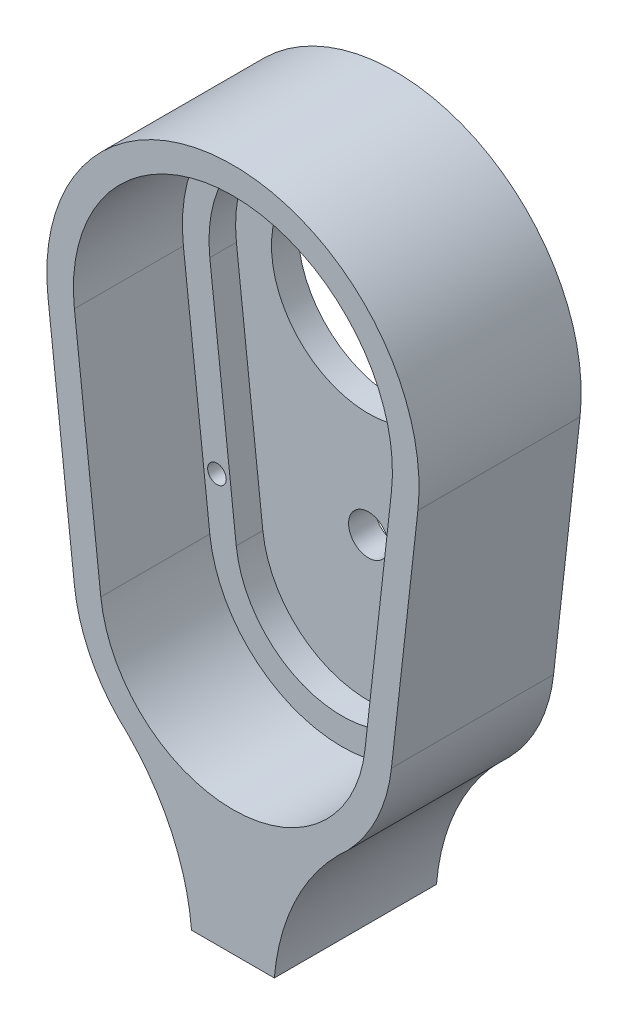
from build123d import *
from build123d.topology import SkipClean

# Parameters (mm, degrees)
BOSS_EXTRUDE_OUTER_RIM_DEPTH         = 15.494
SKETCH1_8_R                          = 9.271
SKETCH1_8_R_2                        = 0.889
BOSS_EXTRUDE_BOTTOM_DEPTH            = 2.54
BOSS_EXTRUDE_INNER_RIDGE_DEPTH       = 2.54
BOSS_EXTRUDE_HANDLE_ATTACHMENT_DEPTH = 15.494
SKETCH3_R                            = 1.905
CUT_EXTRUDE_KNOB_HOLE_DEPTH          = 2.54


with BuildPart() as part:
    # Sketch Outer Ridge → Boss-Extrude Outer Rim (new body)
    with BuildSketch(Plane.XY):
        with BuildLine():
            ThreePointArc((0, -38.1), (10.16, -34.219225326), (15.145633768, -24.553333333))
            ThreePointArc((15.145633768, -24.553333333), (15.216390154, -23.70798036), (15.24, -22.86))
            ThreePointArc((15.24, -22.86), (14.81337526, -19.279285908), (13.557386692, -15.899047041))
            Line((13.557386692, -15.899047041), (12.621361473, -24.271111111))
            ThreePointArc((12.621361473, -24.271111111), (8.466666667, -32.326021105), (0, -35.56))
            Line((0, -35.56), (0, -38.1))
        make_face()
        with BuildLine():
            ThreePointArc((-15.145633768, -24.553333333), (-10.16, -34.219225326), (0, -38.1))
            Line((0, -38.1), (0, -35.56))
            ThreePointArc((0, -35.56), (-8.466666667, -32.326021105), (-12.621361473, -24.271111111))
            Line((-12.621361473, -24.271111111), (-13.557386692, -15.899047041))
            ThreePointArc((-13.557386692, -15.899047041), (-14.989663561, -20.109075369), (-15.145633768, -24.553333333))
        make_face()
        with BuildLine():
            Line((-17.669906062, -1.975555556), (-15.145633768, -24.553333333))
            ThreePointArc((-15.145633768, -24.553333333), (-14.989663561, -20.109075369), (-13.557386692, -15.899047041))
            Line((-13.557386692, -15.899047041), (-14.128067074, -10.794726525))
            ThreePointArc((-14.128067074, -10.794726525), (-16.499158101, -6.626174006), (-17.669906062, -1.975555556))
        make_face()
        with BuildLine():
            Line((0, 15.24), (0, 17.78))
            ThreePointArc((0, 17.78), (-13.252429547, 11.853333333), (-17.669906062, -1.975555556))
            ThreePointArc((-17.669906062, -1.975555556), (-16.499158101, -6.626174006), (-14.128067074, -10.794726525))
            Line((-14.128067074, -10.794726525), (-15.145633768, -1.693333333))
            ThreePointArc((-15.145633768, -1.693333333), (-11.359225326, 10.16), (0, 15.24))
        make_face()
        with BuildLine():
            Line((15.145633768, -24.553333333), (17.669906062, -1.975555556))
            ThreePointArc((17.669906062, -1.975555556), (16.499158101, -6.626174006), (14.128067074, -10.794726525))
            Line((14.128067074, -10.794726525), (13.557386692, -15.899047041))
            ThreePointArc((13.557386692, -15.899047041), (14.81337526, -19.279285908), (15.24, -22.86))
            ThreePointArc((15.24, -22.86), (15.216390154, -23.70798036), (15.145633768, -24.553333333))
        make_face()
        with BuildLine():
            ThreePointArc((14.128067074, -10.794726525), (16.499158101, -6.626174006), (17.669906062, -1.975555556))
            ThreePointArc((17.669906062, -1.975555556), (17.752455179, -0.98931042), (17.78, 0))
            ThreePointArc((17.78, 0), (12.572358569, 12.572358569), (0, 17.78))
            Line((0, 17.78), (0, 15.24))
            ThreePointArc((0, 15.24), (10.776307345, 10.776307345), (15.24, 0))
            ThreePointArc((15.24, 0), (15.216390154, -0.84798036), (15.145633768, -1.693333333))
            Line((15.145633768, -1.693333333), (14.128067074, -10.794726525))
        make_face()
    extrude(amount=BOSS_EXTRUDE_OUTER_RIM_DEPTH)

    # Sketch1_8 → Boss-Extrude Bottom (add)
    with BuildSketch(Plane.XY):
        with BuildLine():
            ThreePointArc((15.145633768, -1.693333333), (0, 15.24), (-15.145633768, -1.693333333))
            Line((-15.145633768, -1.693333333), (-12.621361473, -24.271111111))
            ThreePointArc((-12.621361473, -24.271111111), (0, -35.56), (12.621361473, -24.271111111))
            Line((12.621361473, -24.271111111), (15.145633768, -1.693333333))
        make_face()
        Circle(SKETCH1_8_R, mode=Mode.SUBTRACT)
        with Locations((-11.938, -18.953281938)):
            Circle(SKETCH1_8_R_2, mode=Mode.SUBTRACT)
        with Locations((11.938, -18.953281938)):
            Circle(SKETCH1_8_R_2, mode=Mode.SUBTRACT)
    extrude(amount=BOSS_EXTRUDE_BOTTOM_DEPTH)

    # Sketch Inner Ridge → Boss-Extrude Inner Ridge (add)
    with SkipClean():  # the faces are left unmerged after this step: merging them gives an invalid solid
        with BuildSketch(Plane.XY.offset(2.54)):
            with BuildLine():
                Line((0, 12.7), (0, 15.24))
                ThreePointArc((0, 15.24), (-11.359225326, 10.16), (-15.145633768, -1.693333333))
                ThreePointArc((-15.145633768, -1.693333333), (-14.012017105, -5.993411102), (-11.685336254, -9.783175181))
                Line((-11.685336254, -9.783175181), (-12.621361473, -1.411111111))
                ThreePointArc((-12.621361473, -1.411111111), (-9.466021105, 8.466666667), (0, 12.7))
            make_face()
            with BuildLine():
                ThreePointArc((-11.685336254, -9.783175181), (-14.012017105, -5.993411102), (-15.145633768, -1.693333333))
                Line((-15.145633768, -1.693333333), (-12.621361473, -24.271111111))
                ThreePointArc((-12.621361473, -24.271111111), (-12.67091119, -22.000925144), (-12.315390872, -19.758202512))
                ThreePointArc((-12.315390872, -19.758202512), (-12.782908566, -18.676785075), (-11.766517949, -18.080977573))
                ThreePointArc((-11.766517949, -18.080977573), (-11.385609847, -17.233465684), (-10.943755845, -16.416072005))
                Line((-10.943755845, -16.416072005), (-11.685336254, -9.783175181))
            make_face()
            with BuildLine():
                ThreePointArc((-12.315390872, -19.758202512), (-12.67091119, -22.000925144), (-12.621361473, -24.271111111))
                ThreePointArc((-12.621361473, -24.271111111), (-8.466666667, -32.326021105), (0, -35.56))
                Line((0, -35.56), (0, -33.02))
                ThreePointArc((0, -33.02), (-6.773333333, -30.432816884), (-10.097089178, -23.988888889))
                Line((-10.097089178, -23.988888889), (-10.943755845, -16.416072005))
                ThreePointArc((-10.943755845, -16.416072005), (-11.385609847, -17.233465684), (-11.766517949, -18.080977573))
                ThreePointArc((-11.766517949, -18.080977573), (-11.251425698, -18.388537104), (-11.049, -18.953281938))
                ThreePointArc((-11.049, -18.953281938), (-11.461124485, -19.703555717), (-12.315390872, -19.758202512))
            make_face()
            with BuildLine():
                ThreePointArc((0, -35.56), (8.466666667, -32.326021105), (12.621361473, -24.271111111))
                ThreePointArc((12.621361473, -24.271111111), (12.680325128, -23.5666503), (12.7, -22.86))
                ThreePointArc((12.7, -22.86), (12.603480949, -21.297224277), (12.315390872, -19.758202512))
                ThreePointArc((12.315390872, -19.758202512), (11.093091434, -19.229778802), (11.766517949, -18.080977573))
                ThreePointArc((11.766517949, -18.080977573), (11.385609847, -17.233465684), (10.943755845, -16.416072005))
                Line((10.943755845, -16.416072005), (10.097089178, -23.988888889))
                ThreePointArc((10.097089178, -23.988888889), (6.773333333, -30.432816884), (0, -33.02))
                Line((0, -33.02), (0, -35.56))
            make_face()
            with BuildLine():
                Line((12.621361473, -24.271111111), (15.145633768, -1.693333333))
                ThreePointArc((15.145633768, -1.693333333), (14.012017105, -5.993411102), (11.685336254, -9.783175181))
                Line((11.685336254, -9.783175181), (10.943755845, -16.416072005))
                ThreePointArc((10.943755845, -16.416072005), (11.385609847, -17.233465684), (11.766517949, -18.080977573))
                ThreePointArc((11.766517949, -18.080977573), (12.502744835, -18.266707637), (12.827, -18.953281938))
                ThreePointArc((12.827, -18.953281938), (12.688273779, -19.430157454), (12.315390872, -19.758202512))
                ThreePointArc((12.315390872, -19.758202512), (12.603480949, -21.297224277), (12.7, -22.86))
                ThreePointArc((12.7, -22.86), (12.680325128, -23.5666503), (12.621361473, -24.271111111))
            make_face()
            with BuildLine():
                ThreePointArc((15.24, 0), (10.776307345, 10.776307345), (0, 15.24))
                Line((0, 15.24), (0, 12.7))
                ThreePointArc((0, 12.7), (8.980256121, 8.980256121), (12.7, 0))
                ThreePointArc((12.7, 0), (12.680325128, -0.7066503), (12.621361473, -1.411111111))
                Line((12.621361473, -1.411111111), (11.685336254, -9.783175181))
                ThreePointArc((11.685336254, -9.783175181), (14.012017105, -5.993411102), (15.145633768, -1.693333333))
                ThreePointArc((15.145633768, -1.693333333), (15.216390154, -0.84798036), (15.24, 0))
            make_face()
        extrude(amount=BOSS_EXTRUDE_INNER_RIDGE_DEPTH)

    # Sketch Handle Attachment → Boss-Extrude Handle Attachment (add)
    with SkipClean():  # the faces are left unmerged after this step: merging them gives an invalid solid
        with BuildSketch(Plane.XY):
            with BuildLine():
                Line((0, -47.511750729), (0, -37.992019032))
                ThreePointArc((0, -37.992019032), (-5.479817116, -36.990625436), (-10.251301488, -34.1158869))
                ThreePointArc((-10.251301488, -34.1158869), (-5.901791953, -40.248837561), (-3.957207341, -47.511750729))
                Line((-3.957207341, -47.511750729), (0, -47.511750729))
            make_face()
            with BuildLine():
                ThreePointArc((10.251301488, -34.1158869), (5.479817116, -36.990625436), (0, -37.992019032))
                Line((0, -37.992019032), (0, -47.511750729))
                Line((0, -47.511750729), (3.957207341, -47.511750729))
                ThreePointArc((3.957207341, -47.511750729), (5.901791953, -40.248837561), (10.251301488, -34.1158869))
            make_face()
        extrude(amount=BOSS_EXTRUDE_HANDLE_ATTACHMENT_DEPTH)

    # Sketch3 → Cut-Extrude Knob Hole (cut)
    with SkipClean():  # the faces are left unmerged after this step: merging them gives an invalid solid
        with BuildSketch(Plane.XY.offset(2.54)):
            with Locations((0, -19.304)):
                Circle(SKETCH3_R)
        extrude(amount=-CUT_EXTRUDE_KNOB_HOLE_DEPTH, mode=Mode.SUBTRACT)


solid = part.part
